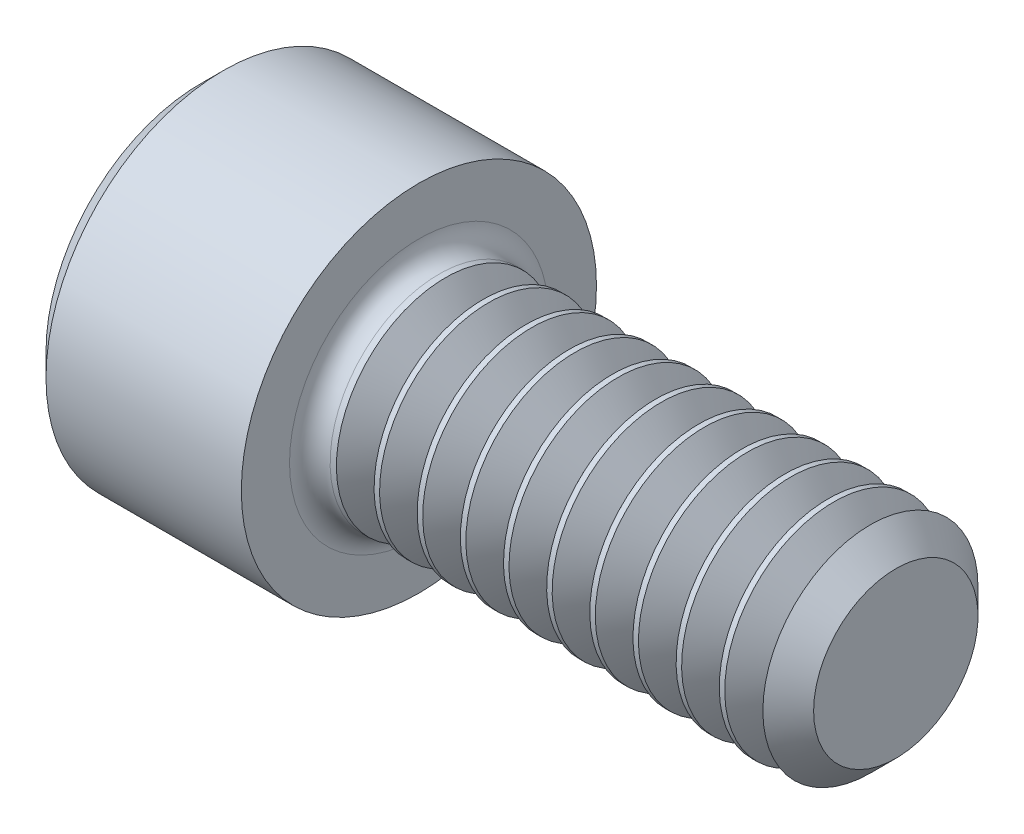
ISO-10303-21;
HEADER;
FILE_DESCRIPTION(('STEP AP214'),'2;1');
FILE_NAME('part.step','',(''),(''),'','','');
FILE_SCHEMA(('AUTOMOTIVE_DESIGN { 1 0 10303 214 1 1 1 1 }'));
ENDSEC;
DATA;
#1=APPLICATION_CONTEXT('core data for automotive mechanical design processes');
#2=APPLICATION_PROTOCOL_DEFINITION('international standard','automotive_design',2000,#1);
#3=PRODUCT_CONTEXT('',#1,'mechanical');
#4=PRODUCT('Part','Part','',(#3));
#5=PRODUCT_RELATED_PRODUCT_CATEGORY('part','',(#4));
#6=PRODUCT_DEFINITION_FORMATION('','',#4);
#7=PRODUCT_DEFINITION_CONTEXT('part definition',#1,'design');
#8=PRODUCT_DEFINITION('design','',#6,#7);
#9=PRODUCT_DEFINITION_SHAPE('','',#8);
#10=(LENGTH_UNIT() NAMED_UNIT(*) SI_UNIT(.MILLI.,.METRE.));
#11=(NAMED_UNIT(*) PLANE_ANGLE_UNIT() SI_UNIT($,.RADIAN.));
#12=(NAMED_UNIT(*) SI_UNIT($,.STERADIAN.) SOLID_ANGLE_UNIT());
#13=UNCERTAINTY_MEASURE_WITH_UNIT(LENGTH_MEASURE(1.E-05),#10,'distance_accuracy_value','');
#14=(GEOMETRIC_REPRESENTATION_CONTEXT(3) GLOBAL_UNCERTAINTY_ASSIGNED_CONTEXT((#13)) GLOBAL_UNIT_ASSIGNED_CONTEXT((#10,
#11,#12)) REPRESENTATION_CONTEXT('',''));
#15=CARTESIAN_POINT('',(0.,0.,0.));
#16=DIRECTION('',(0.,0.,1.));
#17=DIRECTION('',(1.,0.,0.));
#18=AXIS2_PLACEMENT_3D('',#15,#16,#17);
#19=CARTESIAN_POINT('',(0.,0.,0.));
#20=DIRECTION('',(-1.,0.,0.));
#21=DIRECTION('',(0.,0.,1.));
#22=AXIS2_PLACEMENT_3D('',#19,#20,#21);
#23=PLANE('',#22);
#24=DIRECTION('',(0.,-0.499999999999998,0.86602540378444));
#25=VECTOR('',#24,1.);
#26=CARTESIAN_POINT('',(0.,1.14384635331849,0.));
#27=LINE('',#26,#25);
#28=CARTESIAN_POINT('',(0.,1.14384635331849,0.));
#29=VERTEX_POINT('',#28);
#30=CARTESIAN_POINT('',(0.,0.57192317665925,0.990599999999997));
#31=VERTEX_POINT('',#30);
#32=EDGE_CURVE('E722',#29,#31,#27,.T.);
#33=ORIENTED_EDGE('',*,*,#32,.T.);
#34=DIRECTION('',(0.,1.,0.));
#35=VECTOR('',#34,1.);
#36=CARTESIAN_POINT('',(0.,-0.571923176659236,0.990599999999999));
#37=LINE('',#36,#35);
#38=CARTESIAN_POINT('',(0.,-0.571923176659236,0.990599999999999));
#39=VERTEX_POINT('',#38);
#40=EDGE_CURVE('E129',#39,#31,#37,.T.);
#41=ORIENTED_EDGE('',*,*,#40,.F.);
#42=DIRECTION('',(0.,-0.500000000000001,-0.866025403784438));
#43=VECTOR('',#42,1.);
#44=CARTESIAN_POINT('',(0.,-0.571923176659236,0.990599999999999));
#45=LINE('',#44,#43);
#46=CARTESIAN_POINT('',(0.,-1.14384635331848,0.));
#47=VERTEX_POINT('',#46);
#48=EDGE_CURVE('E741',#39,#47,#45,.T.);
#49=ORIENTED_EDGE('',*,*,#48,.T.);
#50=DIRECTION('',(0.,0.499999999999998,-0.86602540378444));
#51=VECTOR('',#50,1.);
#52=CARTESIAN_POINT('',(0.,-1.14384635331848,0.));
#53=LINE('',#52,#51);
#54=CARTESIAN_POINT('',(0.,-0.571923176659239,-0.990600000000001));
#55=VERTEX_POINT('',#54);
#56=EDGE_CURVE('E744',#47,#55,#53,.T.);
#57=ORIENTED_EDGE('',*,*,#56,.T.);
#58=DIRECTION('',(0.,-1.,0.));
#59=VECTOR('',#58,1.);
#60=CARTESIAN_POINT('',(0.,0.571923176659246,-0.990600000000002));
#61=LINE('',#60,#59);
#62=CARTESIAN_POINT('',(0.,0.571923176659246,-0.990600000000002));
#63=VERTEX_POINT('',#62);
#64=EDGE_CURVE('E747',#63,#55,#61,.T.);
#65=ORIENTED_EDGE('',*,*,#64,.F.);
#66=DIRECTION('',(0.,-0.500000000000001,-0.866025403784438));
#67=VECTOR('',#66,1.);
#68=CARTESIAN_POINT('',(0.,1.14384635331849,0.));
#69=LINE('',#68,#67);
#70=EDGE_CURVE('E124',#29,#63,#69,.T.);
#71=ORIENTED_EDGE('',*,*,#70,.F.);
#72=EDGE_LOOP('',(#33,#41,#49,#57,#65,#71));
#73=FACE_BOUND('',#72,.T.);
#74=CARTESIAN_POINT('',(0.,0.,0.));
#75=DIRECTION('',(-1.,0.,0.));
#76=DIRECTION('',(0.,0.,1.));
#77=AXIS2_PLACEMENT_3D('',#74,#75,#76);
#78=CIRCLE('',#77,1.5494);
#79=CARTESIAN_POINT('',(0.,0.,1.5494));
#80=VERTEX_POINT('',#79);
#81=EDGE_CURVE('E140',#80,#80,#78,.T.);
#82=ORIENTED_EDGE('',*,*,#81,.T.);
#83=EDGE_LOOP('',(#82));
#84=FACE_BOUND('',#83,.T.);
#85=ADVANCED_FACE('F32',(#73,#84),#23,.T.);
#86=CARTESIAN_POINT('',(-31.75,0.,0.));
#87=DIRECTION('',(-1.,0.,0.));
#88=DIRECTION('',(0.,0.,1.));
#89=AXIS2_PLACEMENT_3D('',#86,#87,#88);
#90=CYLINDRICAL_SURFACE('',#89,1.09219999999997);
#91=CARTESIAN_POINT('',(2.45053612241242,0.,0.));
#92=DIRECTION('',(-1.,0.,0.));
#93=DIRECTION('',(0.,-1.,0.));
#94=AXIS2_PLACEMENT_3D('',#91,#92,#93);
#95=CIRCLE('',#94,1.0922);
#96=CARTESIAN_POINT('',(2.45053612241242,-1.0922,0.));
#97=VERTEX_POINT('',#96);
#98=EDGE_CURVE('E717',#97,#97,#95,.T.);
#99=ORIENTED_EDGE('',*,*,#98,.T.);
#100=EDGE_LOOP('',(#99));
#101=FACE_BOUND('',#100,.T.);
#102=CARTESIAN_POINT('',(2.3876,0.,0.));
#103=DIRECTION('',(1.,0.,0.));
#104=DIRECTION('',(0.,0.,-1.));
#105=AXIS2_PLACEMENT_3D('',#102,#103,#104);
#106=CIRCLE('',#105,1.09219999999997);
#107=CARTESIAN_POINT('',(2.3876,0.,-1.09219999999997));
#108=VERTEX_POINT('',#107);
#109=EDGE_CURVE('E11',#108,#108,#106,.T.);
#110=ORIENTED_EDGE('',*,*,#109,.T.);
#111=EDGE_LOOP('',(#110));
#112=FACE_BOUND('',#111,.T.);
#113=ADVANCED_FACE('F172',(#101,#112),#90,.T.);
#114=CARTESIAN_POINT('',(2.1844,1.778,0.));
#115=DIRECTION('',(1.,0.,0.));
#116=DIRECTION('',(0.,0.,-1.));
#117=AXIS2_PLACEMENT_3D('',#114,#115,#116);
#118=PLANE('',#117);
#119=CARTESIAN_POINT('',(2.1844,0.,0.));
#120=DIRECTION('',(1.,0.,0.));
#121=DIRECTION('',(0.,0.,-1.));
#122=AXIS2_PLACEMENT_3D('',#119,#120,#121);
#123=CIRCLE('',#122,1.29539999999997);
#124=CARTESIAN_POINT('',(2.1844,0.,-1.29539999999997));
#125=VERTEX_POINT('',#124);
#126=EDGE_CURVE('E41',#125,#125,#123,.F.);
#127=ORIENTED_EDGE('',*,*,#126,.T.);
#128=EDGE_LOOP('',(#127));
#129=FACE_BOUND('',#128,.T.);
#130=CARTESIAN_POINT('',(2.1844,0.,0.));
#131=DIRECTION('',(-1.,0.,0.));
#132=DIRECTION('',(0.,0.,1.));
#133=AXIS2_PLACEMENT_3D('',#130,#131,#132);
#134=CIRCLE('',#133,1.778);
#135=CARTESIAN_POINT('',(2.1844,0.,1.778));
#136=VERTEX_POINT('',#135);
#137=EDGE_CURVE('E147',#136,#136,#134,.T.);
#138=ORIENTED_EDGE('',*,*,#137,.F.);
#139=EDGE_LOOP('',(#138));
#140=FACE_BOUND('',#139,.T.);
#141=ADVANCED_FACE('F156',(#129,#140),#118,.T.);
#142=CARTESIAN_POINT('',(-31.75,0.,0.));
#143=DIRECTION('',(-1.,0.,0.));
#144=DIRECTION('',(0.,0.,1.));
#145=AXIS2_PLACEMENT_3D('',#142,#143,#144);
#146=CYLINDRICAL_SURFACE('',#145,1.778);
#147=ORIENTED_EDGE('',*,*,#137,.T.);
#148=EDGE_LOOP('',(#147));
#149=FACE_BOUND('',#148,.T.);
#150=CARTESIAN_POINT('',(0.228600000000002,0.,0.));
#151=DIRECTION('',(-1.,0.,0.));
#152=DIRECTION('',(0.,0.,1.));
#153=AXIS2_PLACEMENT_3D('',#150,#151,#152);
#154=CIRCLE('',#153,1.778);
#155=CARTESIAN_POINT('',(0.228600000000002,0.,1.778));
#156=VERTEX_POINT('',#155);
#157=EDGE_CURVE('E144',#156,#156,#154,.T.);
#158=ORIENTED_EDGE('',*,*,#157,.F.);
#159=EDGE_LOOP('',(#158));
#160=FACE_BOUND('',#159,.T.);
#161=ADVANCED_FACE('F167',(#149,#160),#146,.T.);
#162=CARTESIAN_POINT('',(0.,0.,0.));
#163=DIRECTION('',(1.,0.,0.));
#164=DIRECTION('',(0.,0.,-1.));
#165=AXIS2_PLACEMENT_3D('',#162,#163,#164);
#166=CONICAL_SURFACE('',#165,1.5494,0.785398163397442);
#167=ORIENTED_EDGE('',*,*,#157,.T.);
#168=EDGE_LOOP('',(#167));
#169=FACE_BOUND('',#168,.T.);
#170=ORIENTED_EDGE('',*,*,#81,.F.);
#171=EDGE_LOOP('',(#170));
#172=FACE_BOUND('',#171,.T.);
#173=ADVANCED_FACE('F160',(#169,#172),#166,.T.);
#174=CARTESIAN_POINT('',(2.3876,0.,0.));
#175=DIRECTION('',(1.,0.,0.));
#176=DIRECTION('',(0.,0.,-1.));
#177=AXIS2_PLACEMENT_3D('',#174,#175,#176);
#178=TOROIDAL_SURFACE('',#177,1.29539999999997,0.2032);
#179=ORIENTED_EDGE('',*,*,#109,.F.);
#180=EDGE_LOOP('',(#179));
#181=FACE_BOUND('',#180,.T.);
#182=ORIENTED_EDGE('',*,*,#126,.F.);
#183=EDGE_LOOP('',(#182));
#184=FACE_BOUND('',#183,.T.);
#185=ADVANCED_FACE('F34',(#181,#184),#178,.F.);
#186=CARTESIAN_POINT('',(0.9652,1.14384635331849,0.));
#187=DIRECTION('',(0.,-0.86602540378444,-0.499999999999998));
#188=DIRECTION('',(0.,0.499999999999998,-0.86602540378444));
#189=AXIS2_PLACEMENT_3D('',#186,#187,#188);
#190=PLANE('',#189);
#191=ORIENTED_EDGE('',*,*,#32,.F.);
#192=DIRECTION('',(-1.,0.,0.));
#193=VECTOR('',#192,1.);
#194=CARTESIAN_POINT('',(0.9652,1.14384635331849,0.));
#195=LINE('',#194,#193);
#196=CARTESIAN_POINT('',(0.9652,1.14384635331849,0.));
#197=VERTEX_POINT('',#196);
#198=EDGE_CURVE('E738',#197,#29,#195,.T.);
#199=ORIENTED_EDGE('',*,*,#198,.F.);
#200=DIRECTION('',(0.,-0.499999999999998,0.86602540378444));
#201=VECTOR('',#200,1.);
#202=CARTESIAN_POINT('',(0.9652,1.14384635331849,0.));
#203=LINE('',#202,#201);
#204=CARTESIAN_POINT('',(0.9652,0.857884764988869,0.4953));
#205=VERTEX_POINT('',#204);
#206=EDGE_CURVE('E116',#197,#205,#203,.T.);
#207=ORIENTED_EDGE('',*,*,#206,.T.);
#208=CARTESIAN_POINT('',(0.9652,0.57192317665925,0.990599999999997));
#209=VERTEX_POINT('',#208);
#210=EDGE_CURVE('E107',#205,#209,#203,.T.);
#211=ORIENTED_EDGE('',*,*,#210,.T.);
#212=DIRECTION('',(-1.,0.,0.));
#213=VECTOR('',#212,1.);
#214=CARTESIAN_POINT('',(0.9652,0.57192317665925,0.990599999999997));
#215=LINE('',#214,#213);
#216=EDGE_CURVE('E121',#209,#31,#215,.T.);
#217=ORIENTED_EDGE('',*,*,#216,.T.);
#218=EDGE_LOOP('',(#191,#199,#207,#211,#217));
#219=FACE_BOUND('',#218,.T.);
#220=ADVANCED_FACE('F120',(#219),#190,.T.);
#221=CARTESIAN_POINT('',(0.9652,-0.571923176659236,0.990599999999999));
#222=DIRECTION('',(0.,0.,1.));
#223=DIRECTION('',(0.,-1.,0.));
#224=AXIS2_PLACEMENT_3D('',#221,#222,#223);
#225=PLANE('',#224);
#226=ORIENTED_EDGE('',*,*,#40,.T.);
#227=ORIENTED_EDGE('',*,*,#216,.F.);
#228=DIRECTION('',(0.,1.,0.));
#229=VECTOR('',#228,1.);
#230=CARTESIAN_POINT('',(0.9652,-0.571923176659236,0.990599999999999));
#231=LINE('',#230,#229);
#232=CARTESIAN_POINT('',(0.9652,0.,0.990599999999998));
#233=VERTEX_POINT('',#232);
#234=EDGE_CURVE('E104',#233,#209,#231,.T.);
#235=ORIENTED_EDGE('',*,*,#234,.F.);
#236=CARTESIAN_POINT('',(0.9652,-0.571923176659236,0.990599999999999));
#237=VERTEX_POINT('',#236);
#238=EDGE_CURVE('E115',#237,#233,#231,.T.);
#239=ORIENTED_EDGE('',*,*,#238,.F.);
#240=DIRECTION('',(-1.,0.,0.));
#241=VECTOR('',#240,1.);
#242=CARTESIAN_POINT('',(0.9652,-0.571923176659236,0.990599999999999));
#243=LINE('',#242,#241);
#244=EDGE_CURVE('E131',#237,#39,#243,.T.);
#245=ORIENTED_EDGE('',*,*,#244,.T.);
#246=EDGE_LOOP('',(#226,#227,#235,#239,#245));
#247=FACE_BOUND('',#246,.T.);
#248=ADVANCED_FACE('F126',(#247),#225,.F.);
#249=CARTESIAN_POINT('',(0.9652,-0.571923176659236,0.990599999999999));
#250=DIRECTION('',(0.,0.866025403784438,-0.500000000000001));
#251=DIRECTION('',(0.,0.500000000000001,0.866025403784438));
#252=AXIS2_PLACEMENT_3D('',#249,#250,#251);
#253=PLANE('',#252);
#254=ORIENTED_EDGE('',*,*,#48,.F.);
#255=ORIENTED_EDGE('',*,*,#244,.F.);
#256=DIRECTION('',(0.,-0.500000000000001,-0.866025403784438));
#257=VECTOR('',#256,1.);
#258=CARTESIAN_POINT('',(0.9652,-0.571923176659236,0.990599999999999));
#259=LINE('',#258,#257);
#260=CARTESIAN_POINT('',(0.9652,-0.857884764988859,0.495299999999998));
#261=VERTEX_POINT('',#260);
#262=EDGE_CURVE('E725',#237,#261,#259,.T.);
#263=ORIENTED_EDGE('',*,*,#262,.T.);
#264=CARTESIAN_POINT('',(0.9652,-1.14384635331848,0.));
#265=VERTEX_POINT('',#264);
#266=EDGE_CURVE('E724',#261,#265,#259,.T.);
#267=ORIENTED_EDGE('',*,*,#266,.T.);
#268=DIRECTION('',(-1.,0.,0.));
#269=VECTOR('',#268,1.);
#270=CARTESIAN_POINT('',(0.9652,-1.14384635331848,0.));
#271=LINE('',#270,#269);
#272=EDGE_CURVE('E136',#265,#47,#271,.T.);
#273=ORIENTED_EDGE('',*,*,#272,.T.);
#274=EDGE_LOOP('',(#254,#255,#263,#267,#273));
#275=FACE_BOUND('',#274,.T.);
#276=ADVANCED_FACE('F310',(#275),#253,.T.);
#277=CARTESIAN_POINT('',(0.9652,-1.14384635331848,0.));
#278=DIRECTION('',(0.,0.86602540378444,0.499999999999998));
#279=DIRECTION('',(0.,-0.499999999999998,0.86602540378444));
#280=AXIS2_PLACEMENT_3D('',#277,#278,#279);
#281=PLANE('',#280);
#282=ORIENTED_EDGE('',*,*,#56,.F.);
#283=ORIENTED_EDGE('',*,*,#272,.F.);
#284=DIRECTION('',(0.,0.499999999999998,-0.86602540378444));
#285=VECTOR('',#284,1.);
#286=CARTESIAN_POINT('',(0.9652,-1.14384635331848,0.));
#287=LINE('',#286,#285);
#288=CARTESIAN_POINT('',(0.9652,-0.857884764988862,-0.495299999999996));
#289=VERTEX_POINT('',#288);
#290=EDGE_CURVE('E729',#265,#289,#287,.T.);
#291=ORIENTED_EDGE('',*,*,#290,.T.);
#292=CARTESIAN_POINT('',(0.9652,-0.571923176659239,-0.990600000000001));
#293=VERTEX_POINT('',#292);
#294=EDGE_CURVE('E728',#289,#293,#287,.T.);
#295=ORIENTED_EDGE('',*,*,#294,.T.);
#296=DIRECTION('',(-1.,0.,0.));
#297=VECTOR('',#296,1.);
#298=CARTESIAN_POINT('',(0.9652,-0.571923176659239,-0.990600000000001));
#299=LINE('',#298,#297);
#300=EDGE_CURVE('E756',#293,#55,#299,.T.);
#301=ORIENTED_EDGE('',*,*,#300,.T.);
#302=EDGE_LOOP('',(#282,#283,#291,#295,#301));
#303=FACE_BOUND('',#302,.T.);
#304=ADVANCED_FACE('F306',(#303),#281,.T.);
#305=CARTESIAN_POINT('',(0.9652,0.571923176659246,-0.990600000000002));
#306=DIRECTION('',(0.,0.,-1.));
#307=DIRECTION('',(0.,1.,0.));
#308=AXIS2_PLACEMENT_3D('',#305,#306,#307);
#309=PLANE('',#308);
#310=ORIENTED_EDGE('',*,*,#64,.T.);
#311=ORIENTED_EDGE('',*,*,#300,.F.);
#312=DIRECTION('',(0.,-1.,0.));
#313=VECTOR('',#312,1.);
#314=CARTESIAN_POINT('',(0.9652,0.571923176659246,-0.990600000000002));
#315=LINE('',#314,#313);
#316=CARTESIAN_POINT('',(0.965200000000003,0.,-0.9906));
#317=VERTEX_POINT('',#316);
#318=EDGE_CURVE('E732',#317,#293,#315,.T.);
#319=ORIENTED_EDGE('',*,*,#318,.F.);
#320=CARTESIAN_POINT('',(0.9652,0.571923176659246,-0.990600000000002));
#321=VERTEX_POINT('',#320);
#322=EDGE_CURVE('E48',#321,#317,#315,.T.);
#323=ORIENTED_EDGE('',*,*,#322,.F.);
#324=DIRECTION('',(-1.,0.,0.));
#325=VECTOR('',#324,1.);
#326=CARTESIAN_POINT('',(0.9652,0.571923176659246,-0.990600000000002));
#327=LINE('',#326,#325);
#328=EDGE_CURVE('E753',#321,#63,#327,.T.);
#329=ORIENTED_EDGE('',*,*,#328,.T.);
#330=EDGE_LOOP('',(#310,#311,#319,#323,#329));
#331=FACE_BOUND('',#330,.T.);
#332=ADVANCED_FACE('F302',(#331),#309,.F.);
#333=CARTESIAN_POINT('',(0.9652,1.14384635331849,0.));
#334=DIRECTION('',(0.,0.866025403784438,-0.500000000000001));
#335=DIRECTION('',(0.,0.500000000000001,0.866025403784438));
#336=AXIS2_PLACEMENT_3D('',#333,#334,#335);
#337=PLANE('',#336);
#338=ORIENTED_EDGE('',*,*,#70,.T.);
#339=ORIENTED_EDGE('',*,*,#328,.F.);
#340=DIRECTION('',(0.,-0.500000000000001,-0.866025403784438));
#341=VECTOR('',#340,1.);
#342=CARTESIAN_POINT('',(0.9652,1.14384635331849,0.));
#343=LINE('',#342,#341);
#344=CARTESIAN_POINT('',(0.9652,0.857884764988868,-0.495300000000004));
#345=VERTEX_POINT('',#344);
#346=EDGE_CURVE('E734',#345,#321,#343,.T.);
#347=ORIENTED_EDGE('',*,*,#346,.F.);
#348=EDGE_CURVE('E735',#197,#345,#343,.T.);
#349=ORIENTED_EDGE('',*,*,#348,.F.);
#350=ORIENTED_EDGE('',*,*,#198,.T.);
#351=EDGE_LOOP('',(#338,#339,#347,#349,#350));
#352=FACE_BOUND('',#351,.T.);
#353=ADVANCED_FACE('F297',(#352),#337,.F.);
#354=CARTESIAN_POINT('',(0.9652,1.71576952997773,-0.990600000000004));
#355=DIRECTION('',(1.,0.,0.));
#356=DIRECTION('',(0.,0.,-1.));
#357=AXIS2_PLACEMENT_3D('',#354,#355,#356);
#358=PLANE('',#357);
#359=ORIENTED_EDGE('',*,*,#318,.T.);
#360=ORIENTED_EDGE('',*,*,#294,.F.);
#361=CARTESIAN_POINT('',(0.965200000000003,0.,0.));
#362=DIRECTION('',(-1.,0.,0.));
#363=DIRECTION('',(0.,0.,1.));
#364=AXIS2_PLACEMENT_3D('',#361,#362,#363);
#365=CIRCLE('',#364,0.9906);
#366=EDGE_CURVE('E771',#317,#289,#365,.T.);
#367=ORIENTED_EDGE('',*,*,#366,.F.);
#368=EDGE_LOOP('',(#359,#360,#367));
#369=FACE_BOUND('',#368,.T.);
#370=ADVANCED_FACE('F293',(#369),#358,.F.);
#371=ORIENTED_EDGE('',*,*,#290,.F.);
#372=ORIENTED_EDGE('',*,*,#266,.F.);
#373=EDGE_CURVE('E134',#289,#261,#365,.T.);
#374=ORIENTED_EDGE('',*,*,#373,.F.);
#375=EDGE_LOOP('',(#371,#372,#374));
#376=FACE_BOUND('',#375,.T.);
#377=ADVANCED_FACE('F296',(#376),#358,.F.);
#378=ORIENTED_EDGE('',*,*,#262,.F.);
#379=ORIENTED_EDGE('',*,*,#238,.T.);
#380=EDGE_CURVE('E130',#261,#233,#365,.T.);
#381=ORIENTED_EDGE('',*,*,#380,.F.);
#382=EDGE_LOOP('',(#378,#379,#381));
#383=FACE_BOUND('',#382,.T.);
#384=ADVANCED_FACE('F346',(#383),#358,.F.);
#385=ORIENTED_EDGE('',*,*,#234,.T.);
#386=ORIENTED_EDGE('',*,*,#210,.F.);
#387=EDGE_CURVE('E110',#233,#205,#365,.T.);
#388=ORIENTED_EDGE('',*,*,#387,.F.);
#389=EDGE_LOOP('',(#385,#386,#388));
#390=FACE_BOUND('',#389,.T.);
#391=ADVANCED_FACE('F106',(#390),#358,.F.);
#392=ORIENTED_EDGE('',*,*,#206,.F.);
#393=ORIENTED_EDGE('',*,*,#348,.T.);
#394=EDGE_CURVE('E141',#205,#345,#365,.T.);
#395=ORIENTED_EDGE('',*,*,#394,.F.);
#396=EDGE_LOOP('',(#392,#393,#395));
#397=FACE_BOUND('',#396,.T.);
#398=ADVANCED_FACE('F359',(#397),#358,.F.);
#399=ORIENTED_EDGE('',*,*,#346,.T.);
#400=ORIENTED_EDGE('',*,*,#322,.T.);
#401=EDGE_CURVE('E770',#345,#317,#365,.T.);
#402=ORIENTED_EDGE('',*,*,#401,.F.);
#403=EDGE_LOOP('',(#399,#400,#402));
#404=FACE_BOUND('',#403,.T.);
#405=ADVANCED_FACE('F299',(#404),#358,.F.);
#406=CARTESIAN_POINT('',(0.965200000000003,0.,0.));
#407=DIRECTION('',(-1.,0.,0.));
#408=DIRECTION('',(0.,0.,1.));
#409=AXIS2_PLACEMENT_3D('',#406,#407,#408);
#410=CONICAL_SURFACE('',#409,0.9906,1.04719755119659);
#411=CARTESIAN_POINT('',(1.53712317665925,0.,0.));
#412=VERTEX_POINT('',#411);
#413=VERTEX_LOOP('',#412);
#414=FACE_BOUND('',#413,.T.);
#415=ORIENTED_EDGE('',*,*,#387,.T.);
#416=ORIENTED_EDGE('',*,*,#394,.T.);
#417=ORIENTED_EDGE('',*,*,#401,.T.);
#418=ORIENTED_EDGE('',*,*,#366,.T.);
#419=ORIENTED_EDGE('',*,*,#373,.T.);
#420=ORIENTED_EDGE('',*,*,#380,.T.);
#421=EDGE_LOOP('',(#415,#416,#417,#418,#419,#420));
#422=FACE_BOUND('',#421,.T.);
#423=ADVANCED_FACE('F184',(#414,#422),#410,.F.);
#424=CARTESIAN_POINT('',(2.82758387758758,0.,0.));
#425=DIRECTION('',(1.,0.,0.));
#426=DIRECTION('',(0.,1.,0.));
#427=AXIS2_PLACEMENT_3D('',#424,#425,#426);
#428=CONICAL_SURFACE('',#427,1.0922,0.959931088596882);
#429=CARTESIAN_POINT('',(2.63906,0.,0.));
#430=DIRECTION('',(-1.,0.,0.));
#431=DIRECTION('',(0.,-1.,0.));
#432=AXIS2_PLACEMENT_3D('',#429,#430,#431);
#433=CIRCLE('',#432,0.822960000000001);
#434=CARTESIAN_POINT('',(2.63906,-0.82296,0.));
#435=VERTEX_POINT('',#434);
#436=EDGE_CURVE('E714',#435,#435,#433,.T.);
#437=ORIENTED_EDGE('',*,*,#436,.F.);
#438=EDGE_LOOP('',(#437));
#439=FACE_BOUND('',#438,.T.);
#440=CARTESIAN_POINT('',(2.82758387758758,0.,0.));
#441=DIRECTION('',(-1.,0.,0.));
#442=DIRECTION('',(0.,-1.,0.));
#443=AXIS2_PLACEMENT_3D('',#440,#441,#442);
#444=CIRCLE('',#443,1.0922);
#445=CARTESIAN_POINT('',(2.82758387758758,-1.0922,0.));
#446=VERTEX_POINT('',#445);
#447=EDGE_CURVE('E720',#446,#446,#444,.T.);
#448=ORIENTED_EDGE('',*,*,#447,.T.);
#449=EDGE_LOOP('',(#448));
#450=FACE_BOUND('',#449,.T.);
#451=ADVANCED_FACE('F288',(#439,#450),#428,.T.);
#452=CARTESIAN_POINT('',(2.63906,0.,0.));
#453=DIRECTION('',(-1.,0.,0.));
#454=DIRECTION('',(0.,-1.,0.));
#455=AXIS2_PLACEMENT_3D('',#452,#453,#454);
#456=CONICAL_SURFACE('',#455,0.822960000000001,0.959931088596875);
#457=ORIENTED_EDGE('',*,*,#98,.F.);
#458=EDGE_LOOP('',(#457));
#459=FACE_BOUND('',#458,.T.);
#460=ORIENTED_EDGE('',*,*,#436,.T.);
#461=EDGE_LOOP('',(#460));
#462=FACE_BOUND('',#461,.T.);
#463=ADVANCED_FACE('F285',(#459,#462),#456,.T.);
#464=CARTESIAN_POINT('',(2.88259012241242,0.,0.));
#465=DIRECTION('',(-1.,0.,0.));
#466=DIRECTION('',(0.,-1.,0.));
#467=AXIS2_PLACEMENT_3D('',#464,#465,#466);
#468=CIRCLE('',#467,1.0922);
#469=CARTESIAN_POINT('',(2.88259012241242,-1.0922,0.));
#470=VERTEX_POINT('',#469);
#471=EDGE_CURVE('E708',#470,#470,#468,.T.);
#472=ORIENTED_EDGE('',*,*,#471,.T.);
#473=EDGE_LOOP('',(#472));
#474=FACE_BOUND('',#473,.T.);
#475=ORIENTED_EDGE('',*,*,#447,.F.);
#476=EDGE_LOOP('',(#475));
#477=FACE_BOUND('',#476,.T.);
#478=ADVANCED_FACE('F181',(#474,#477),#90,.T.);
#479=CARTESIAN_POINT('',(3.25963787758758,0.,0.));
#480=DIRECTION('',(1.,0.,0.));
#481=DIRECTION('',(0.,1.,0.));
#482=AXIS2_PLACEMENT_3D('',#479,#480,#481);
#483=CONICAL_SURFACE('',#482,1.0922,0.959931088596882);
#484=CARTESIAN_POINT('',(3.071114,0.,0.));
#485=DIRECTION('',(-1.,0.,0.));
#486=DIRECTION('',(0.,-1.,0.));
#487=AXIS2_PLACEMENT_3D('',#484,#485,#486);
#488=CIRCLE('',#487,0.822960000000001);
#489=CARTESIAN_POINT('',(3.071114,-0.82296,0.));
#490=VERTEX_POINT('',#489);
#491=EDGE_CURVE('E705',#490,#490,#488,.T.);
#492=ORIENTED_EDGE('',*,*,#491,.F.);
#493=EDGE_LOOP('',(#492));
#494=FACE_BOUND('',#493,.T.);
#495=CARTESIAN_POINT('',(3.25963787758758,0.,0.));
#496=DIRECTION('',(-1.,0.,0.));
#497=DIRECTION('',(0.,-1.,0.));
#498=AXIS2_PLACEMENT_3D('',#495,#496,#497);
#499=CIRCLE('',#498,1.0922);
#500=CARTESIAN_POINT('',(3.25963787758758,-1.0922,0.));
#501=VERTEX_POINT('',#500);
#502=EDGE_CURVE('E711',#501,#501,#499,.T.);
#503=ORIENTED_EDGE('',*,*,#502,.T.);
#504=EDGE_LOOP('',(#503));
#505=FACE_BOUND('',#504,.T.);
#506=ADVANCED_FACE('F280',(#494,#505),#483,.T.);
#507=CARTESIAN_POINT('',(3.071114,0.,0.));
#508=DIRECTION('',(-1.,0.,0.));
#509=DIRECTION('',(0.,-1.,0.));
#510=AXIS2_PLACEMENT_3D('',#507,#508,#509);
#511=CONICAL_SURFACE('',#510,0.822960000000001,0.959931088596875);
#512=ORIENTED_EDGE('',*,*,#471,.F.);
#513=EDGE_LOOP('',(#512));
#514=FACE_BOUND('',#513,.T.);
#515=ORIENTED_EDGE('',*,*,#491,.T.);
#516=EDGE_LOOP('',(#515));
#517=FACE_BOUND('',#516,.T.);
#518=ADVANCED_FACE('F277',(#514,#517),#511,.T.);
#519=CARTESIAN_POINT('',(3.31464412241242,0.,0.));
#520=DIRECTION('',(-1.,0.,0.));
#521=DIRECTION('',(0.,-1.,0.));
#522=AXIS2_PLACEMENT_3D('',#519,#520,#521);
#523=CIRCLE('',#522,1.0922);
#524=CARTESIAN_POINT('',(3.31464412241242,-1.0922,0.));
#525=VERTEX_POINT('',#524);
#526=EDGE_CURVE('E699',#525,#525,#523,.T.);
#527=ORIENTED_EDGE('',*,*,#526,.T.);
#528=EDGE_LOOP('',(#527));
#529=FACE_BOUND('',#528,.T.);
#530=ORIENTED_EDGE('',*,*,#502,.F.);
#531=EDGE_LOOP('',(#530));
#532=FACE_BOUND('',#531,.T.);
#533=ADVANCED_FACE('F275',(#529,#532),#90,.T.);
#534=CARTESIAN_POINT('',(3.69169187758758,0.,0.));
#535=DIRECTION('',(1.,0.,0.));
#536=DIRECTION('',(0.,1.,0.));
#537=AXIS2_PLACEMENT_3D('',#534,#535,#536);
#538=CONICAL_SURFACE('',#537,1.0922,0.959931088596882);
#539=CARTESIAN_POINT('',(3.503168,0.,0.));
#540=DIRECTION('',(-1.,0.,0.));
#541=DIRECTION('',(0.,-1.,0.));
#542=AXIS2_PLACEMENT_3D('',#539,#540,#541);
#543=CIRCLE('',#542,0.822960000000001);
#544=CARTESIAN_POINT('',(3.503168,-0.82296,0.));
#545=VERTEX_POINT('',#544);
#546=EDGE_CURVE('E696',#545,#545,#543,.T.);
#547=ORIENTED_EDGE('',*,*,#546,.F.);
#548=EDGE_LOOP('',(#547));
#549=FACE_BOUND('',#548,.T.);
#550=CARTESIAN_POINT('',(3.69169187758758,0.,0.));
#551=DIRECTION('',(-1.,0.,0.));
#552=DIRECTION('',(0.,-1.,0.));
#553=AXIS2_PLACEMENT_3D('',#550,#551,#552);
#554=CIRCLE('',#553,1.0922);
#555=CARTESIAN_POINT('',(3.69169187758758,-1.0922,0.));
#556=VERTEX_POINT('',#555);
#557=EDGE_CURVE('E702',#556,#556,#554,.T.);
#558=ORIENTED_EDGE('',*,*,#557,.T.);
#559=EDGE_LOOP('',(#558));
#560=FACE_BOUND('',#559,.T.);
#561=ADVANCED_FACE('F271',(#549,#560),#538,.T.);
#562=CARTESIAN_POINT('',(3.503168,0.,0.));
#563=DIRECTION('',(-1.,0.,0.));
#564=DIRECTION('',(0.,-1.,0.));
#565=AXIS2_PLACEMENT_3D('',#562,#563,#564);
#566=CONICAL_SURFACE('',#565,0.822960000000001,0.959931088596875);
#567=ORIENTED_EDGE('',*,*,#526,.F.);
#568=EDGE_LOOP('',(#567));
#569=FACE_BOUND('',#568,.T.);
#570=ORIENTED_EDGE('',*,*,#546,.T.);
#571=EDGE_LOOP('',(#570));
#572=FACE_BOUND('',#571,.T.);
#573=ADVANCED_FACE('F268',(#569,#572),#566,.T.);
#574=CARTESIAN_POINT('',(3.74669812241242,0.,0.));
#575=DIRECTION('',(-1.,0.,0.));
#576=DIRECTION('',(0.,-1.,0.));
#577=AXIS2_PLACEMENT_3D('',#574,#575,#576);
#578=CIRCLE('',#577,1.0922);
#579=CARTESIAN_POINT('',(3.74669812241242,-1.0922,0.));
#580=VERTEX_POINT('',#579);
#581=EDGE_CURVE('E690',#580,#580,#578,.T.);
#582=ORIENTED_EDGE('',*,*,#581,.T.);
#583=EDGE_LOOP('',(#582));
#584=FACE_BOUND('',#583,.T.);
#585=ORIENTED_EDGE('',*,*,#557,.F.);
#586=EDGE_LOOP('',(#585));
#587=FACE_BOUND('',#586,.T.);
#588=ADVANCED_FACE('F266',(#584,#587),#90,.T.);
#589=CARTESIAN_POINT('',(4.12374587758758,0.,0.));
#590=DIRECTION('',(1.,0.,0.));
#591=DIRECTION('',(0.,1.,0.));
#592=AXIS2_PLACEMENT_3D('',#589,#590,#591);
#593=CONICAL_SURFACE('',#592,1.0922,0.959931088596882);
#594=CARTESIAN_POINT('',(3.935222,0.,0.));
#595=DIRECTION('',(-1.,0.,0.));
#596=DIRECTION('',(0.,-1.,0.));
#597=AXIS2_PLACEMENT_3D('',#594,#595,#596);
#598=CIRCLE('',#597,0.822960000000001);
#599=CARTESIAN_POINT('',(3.935222,-0.82296,0.));
#600=VERTEX_POINT('',#599);
#601=EDGE_CURVE('E687',#600,#600,#598,.T.);
#602=ORIENTED_EDGE('',*,*,#601,.F.);
#603=EDGE_LOOP('',(#602));
#604=FACE_BOUND('',#603,.T.);
#605=CARTESIAN_POINT('',(4.12374587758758,0.,0.));
#606=DIRECTION('',(-1.,0.,0.));
#607=DIRECTION('',(0.,-1.,0.));
#608=AXIS2_PLACEMENT_3D('',#605,#606,#607);
#609=CIRCLE('',#608,1.0922);
#610=CARTESIAN_POINT('',(4.12374587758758,-1.0922,0.));
#611=VERTEX_POINT('',#610);
#612=EDGE_CURVE('E693',#611,#611,#609,.T.);
#613=ORIENTED_EDGE('',*,*,#612,.T.);
#614=EDGE_LOOP('',(#613));
#615=FACE_BOUND('',#614,.T.);
#616=ADVANCED_FACE('F262',(#604,#615),#593,.T.);
#617=CARTESIAN_POINT('',(3.935222,0.,0.));
#618=DIRECTION('',(-1.,0.,0.));
#619=DIRECTION('',(0.,-1.,0.));
#620=AXIS2_PLACEMENT_3D('',#617,#618,#619);
#621=CONICAL_SURFACE('',#620,0.822960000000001,0.959931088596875);
#622=ORIENTED_EDGE('',*,*,#581,.F.);
#623=EDGE_LOOP('',(#622));
#624=FACE_BOUND('',#623,.T.);
#625=ORIENTED_EDGE('',*,*,#601,.T.);
#626=EDGE_LOOP('',(#625));
#627=FACE_BOUND('',#626,.T.);
#628=ADVANCED_FACE('F259',(#624,#627),#621,.T.);
#629=CARTESIAN_POINT('',(4.17875212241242,0.,0.));
#630=DIRECTION('',(-1.,0.,0.));
#631=DIRECTION('',(0.,-1.,0.));
#632=AXIS2_PLACEMENT_3D('',#629,#630,#631);
#633=CIRCLE('',#632,1.0922);
#634=CARTESIAN_POINT('',(4.17875212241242,-1.0922,0.));
#635=VERTEX_POINT('',#634);
#636=EDGE_CURVE('E681',#635,#635,#633,.T.);
#637=ORIENTED_EDGE('',*,*,#636,.T.);
#638=EDGE_LOOP('',(#637));
#639=FACE_BOUND('',#638,.T.);
#640=ORIENTED_EDGE('',*,*,#612,.F.);
#641=EDGE_LOOP('',(#640));
#642=FACE_BOUND('',#641,.T.);
#643=ADVANCED_FACE('F257',(#639,#642),#90,.T.);
#644=CARTESIAN_POINT('',(4.55579987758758,0.,0.));
#645=DIRECTION('',(1.,0.,0.));
#646=DIRECTION('',(0.,1.,0.));
#647=AXIS2_PLACEMENT_3D('',#644,#645,#646);
#648=CONICAL_SURFACE('',#647,1.0922,0.959931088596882);
#649=CARTESIAN_POINT('',(4.367276,0.,0.));
#650=DIRECTION('',(-1.,0.,0.));
#651=DIRECTION('',(0.,-1.,0.));
#652=AXIS2_PLACEMENT_3D('',#649,#650,#651);
#653=CIRCLE('',#652,0.822960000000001);
#654=CARTESIAN_POINT('',(4.367276,-0.82296,0.));
#655=VERTEX_POINT('',#654);
#656=EDGE_CURVE('E678',#655,#655,#653,.T.);
#657=ORIENTED_EDGE('',*,*,#656,.F.);
#658=EDGE_LOOP('',(#657));
#659=FACE_BOUND('',#658,.T.);
#660=CARTESIAN_POINT('',(4.55579987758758,0.,0.));
#661=DIRECTION('',(-1.,0.,0.));
#662=DIRECTION('',(0.,-1.,0.));
#663=AXIS2_PLACEMENT_3D('',#660,#661,#662);
#664=CIRCLE('',#663,1.0922);
#665=CARTESIAN_POINT('',(4.55579987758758,-1.0922,0.));
#666=VERTEX_POINT('',#665);
#667=EDGE_CURVE('E684',#666,#666,#664,.T.);
#668=ORIENTED_EDGE('',*,*,#667,.T.);
#669=EDGE_LOOP('',(#668));
#670=FACE_BOUND('',#669,.T.);
#671=ADVANCED_FACE('F253',(#659,#670),#648,.T.);
#672=CARTESIAN_POINT('',(4.367276,0.,0.));
#673=DIRECTION('',(-1.,0.,0.));
#674=DIRECTION('',(0.,-1.,0.));
#675=AXIS2_PLACEMENT_3D('',#672,#673,#674);
#676=CONICAL_SURFACE('',#675,0.822960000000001,0.959931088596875);
#677=ORIENTED_EDGE('',*,*,#636,.F.);
#678=EDGE_LOOP('',(#677));
#679=FACE_BOUND('',#678,.T.);
#680=ORIENTED_EDGE('',*,*,#656,.T.);
#681=EDGE_LOOP('',(#680));
#682=FACE_BOUND('',#681,.T.);
#683=ADVANCED_FACE('F250',(#679,#682),#676,.T.);
#684=CARTESIAN_POINT('',(4.61080612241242,0.,0.));
#685=DIRECTION('',(-1.,0.,0.));
#686=DIRECTION('',(0.,-1.,0.));
#687=AXIS2_PLACEMENT_3D('',#684,#685,#686);
#688=CIRCLE('',#687,1.0922);
#689=CARTESIAN_POINT('',(4.61080612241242,-1.0922,0.));
#690=VERTEX_POINT('',#689);
#691=EDGE_CURVE('E672',#690,#690,#688,.T.);
#692=ORIENTED_EDGE('',*,*,#691,.T.);
#693=EDGE_LOOP('',(#692));
#694=FACE_BOUND('',#693,.T.);
#695=ORIENTED_EDGE('',*,*,#667,.F.);
#696=EDGE_LOOP('',(#695));
#697=FACE_BOUND('',#696,.T.);
#698=ADVANCED_FACE('F248',(#694,#697),#90,.T.);
#699=CARTESIAN_POINT('',(4.98785387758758,0.,0.));
#700=DIRECTION('',(1.,0.,0.));
#701=DIRECTION('',(0.,1.,0.));
#702=AXIS2_PLACEMENT_3D('',#699,#700,#701);
#703=CONICAL_SURFACE('',#702,1.0922,0.959931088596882);
#704=CARTESIAN_POINT('',(4.79933,0.,0.));
#705=DIRECTION('',(-1.,0.,0.));
#706=DIRECTION('',(0.,-1.,0.));
#707=AXIS2_PLACEMENT_3D('',#704,#705,#706);
#708=CIRCLE('',#707,0.822960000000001);
#709=CARTESIAN_POINT('',(4.79933,-0.82296,0.));
#710=VERTEX_POINT('',#709);
#711=EDGE_CURVE('E669',#710,#710,#708,.T.);
#712=ORIENTED_EDGE('',*,*,#711,.F.);
#713=EDGE_LOOP('',(#712));
#714=FACE_BOUND('',#713,.T.);
#715=CARTESIAN_POINT('',(4.98785387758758,0.,0.));
#716=DIRECTION('',(-1.,0.,0.));
#717=DIRECTION('',(0.,-1.,0.));
#718=AXIS2_PLACEMENT_3D('',#715,#716,#717);
#719=CIRCLE('',#718,1.0922);
#720=CARTESIAN_POINT('',(4.98785387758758,-1.0922,0.));
#721=VERTEX_POINT('',#720);
#722=EDGE_CURVE('E675',#721,#721,#719,.T.);
#723=ORIENTED_EDGE('',*,*,#722,.T.);
#724=EDGE_LOOP('',(#723));
#725=FACE_BOUND('',#724,.T.);
#726=ADVANCED_FACE('F244',(#714,#725),#703,.T.);
#727=CARTESIAN_POINT('',(4.79933,0.,0.));
#728=DIRECTION('',(-1.,0.,0.));
#729=DIRECTION('',(0.,-1.,0.));
#730=AXIS2_PLACEMENT_3D('',#727,#728,#729);
#731=CONICAL_SURFACE('',#730,0.822960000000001,0.959931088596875);
#732=ORIENTED_EDGE('',*,*,#691,.F.);
#733=EDGE_LOOP('',(#732));
#734=FACE_BOUND('',#733,.T.);
#735=ORIENTED_EDGE('',*,*,#711,.T.);
#736=EDGE_LOOP('',(#735));
#737=FACE_BOUND('',#736,.T.);
#738=ADVANCED_FACE('F241',(#734,#737),#731,.T.);
#739=CARTESIAN_POINT('',(5.04286012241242,0.,0.));
#740=DIRECTION('',(-1.,0.,0.));
#741=DIRECTION('',(0.,-1.,0.));
#742=AXIS2_PLACEMENT_3D('',#739,#740,#741);
#743=CIRCLE('',#742,1.0922);
#744=CARTESIAN_POINT('',(5.04286012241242,-1.0922,0.));
#745=VERTEX_POINT('',#744);
#746=EDGE_CURVE('E663',#745,#745,#743,.T.);
#747=ORIENTED_EDGE('',*,*,#746,.T.);
#748=EDGE_LOOP('',(#747));
#749=FACE_BOUND('',#748,.T.);
#750=ORIENTED_EDGE('',*,*,#722,.F.);
#751=EDGE_LOOP('',(#750));
#752=FACE_BOUND('',#751,.T.);
#753=ADVANCED_FACE('F239',(#749,#752),#90,.T.);
#754=CARTESIAN_POINT('',(5.41990787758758,0.,0.));
#755=DIRECTION('',(1.,0.,0.));
#756=DIRECTION('',(0.,1.,0.));
#757=AXIS2_PLACEMENT_3D('',#754,#755,#756);
#758=CONICAL_SURFACE('',#757,1.0922,0.959931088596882);
#759=CARTESIAN_POINT('',(5.231384,0.,0.));
#760=DIRECTION('',(-1.,0.,0.));
#761=DIRECTION('',(0.,-1.,0.));
#762=AXIS2_PLACEMENT_3D('',#759,#760,#761);
#763=CIRCLE('',#762,0.822960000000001);
#764=CARTESIAN_POINT('',(5.231384,-0.82296,0.));
#765=VERTEX_POINT('',#764);
#766=EDGE_CURVE('E660',#765,#765,#763,.T.);
#767=ORIENTED_EDGE('',*,*,#766,.F.);
#768=EDGE_LOOP('',(#767));
#769=FACE_BOUND('',#768,.T.);
#770=CARTESIAN_POINT('',(5.41990787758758,0.,0.));
#771=DIRECTION('',(-1.,0.,0.));
#772=DIRECTION('',(0.,-1.,0.));
#773=AXIS2_PLACEMENT_3D('',#770,#771,#772);
#774=CIRCLE('',#773,1.0922);
#775=CARTESIAN_POINT('',(5.41990787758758,-1.0922,0.));
#776=VERTEX_POINT('',#775);
#777=EDGE_CURVE('E666',#776,#776,#774,.T.);
#778=ORIENTED_EDGE('',*,*,#777,.T.);
#779=EDGE_LOOP('',(#778));
#780=FACE_BOUND('',#779,.T.);
#781=ADVANCED_FACE('F235',(#769,#780),#758,.T.);
#782=CARTESIAN_POINT('',(5.231384,0.,0.));
#783=DIRECTION('',(-1.,0.,0.));
#784=DIRECTION('',(0.,-1.,0.));
#785=AXIS2_PLACEMENT_3D('',#782,#783,#784);
#786=CONICAL_SURFACE('',#785,0.822960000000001,0.959931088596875);
#787=ORIENTED_EDGE('',*,*,#746,.F.);
#788=EDGE_LOOP('',(#787));
#789=FACE_BOUND('',#788,.T.);
#790=ORIENTED_EDGE('',*,*,#766,.T.);
#791=EDGE_LOOP('',(#790));
#792=FACE_BOUND('',#791,.T.);
#793=ADVANCED_FACE('F232',(#789,#792),#786,.T.);
#794=CARTESIAN_POINT('',(5.47491412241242,0.,0.));
#795=DIRECTION('',(-1.,0.,0.));
#796=DIRECTION('',(0.,-1.,0.));
#797=AXIS2_PLACEMENT_3D('',#794,#795,#796);
#798=CIRCLE('',#797,1.0922);
#799=CARTESIAN_POINT('',(5.47491412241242,-1.0922,0.));
#800=VERTEX_POINT('',#799);
#801=EDGE_CURVE('E648',#800,#800,#798,.T.);
#802=ORIENTED_EDGE('',*,*,#801,.T.);
#803=EDGE_LOOP('',(#802));
#804=FACE_BOUND('',#803,.T.);
#805=ORIENTED_EDGE('',*,*,#777,.F.);
#806=EDGE_LOOP('',(#805));
#807=FACE_BOUND('',#806,.T.);
#808=ADVANCED_FACE('F230',(#804,#807),#90,.T.);
#809=CARTESIAN_POINT('',(5.85196187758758,0.,0.));
#810=DIRECTION('',(1.,0.,0.));
#811=DIRECTION('',(0.,1.,0.));
#812=AXIS2_PLACEMENT_3D('',#809,#810,#811);
#813=CONICAL_SURFACE('',#812,1.0922,0.959931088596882);
#814=CARTESIAN_POINT('',(5.663438,0.,0.));
#815=DIRECTION('',(-1.,0.,0.));
#816=DIRECTION('',(0.,-1.,0.));
#817=AXIS2_PLACEMENT_3D('',#814,#815,#816);
#818=CIRCLE('',#817,0.822960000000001);
#819=CARTESIAN_POINT('',(5.663438,-0.82296,0.));
#820=VERTEX_POINT('',#819);
#821=EDGE_CURVE('E644',#820,#820,#818,.T.);
#822=ORIENTED_EDGE('',*,*,#821,.F.);
#823=EDGE_LOOP('',(#822));
#824=FACE_BOUND('',#823,.T.);
#825=CARTESIAN_POINT('',(5.85196187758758,0.,0.));
#826=DIRECTION('',(-1.,0.,0.));
#827=DIRECTION('',(0.,-1.,0.));
#828=AXIS2_PLACEMENT_3D('',#825,#826,#827);
#829=CIRCLE('',#828,1.0922);
#830=CARTESIAN_POINT('',(5.85196187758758,-1.0922,0.));
#831=VERTEX_POINT('',#830);
#832=EDGE_CURVE('E657',#831,#831,#829,.T.);
#833=ORIENTED_EDGE('',*,*,#832,.T.);
#834=EDGE_LOOP('',(#833));
#835=FACE_BOUND('',#834,.T.);
#836=ADVANCED_FACE('F226',(#824,#835),#813,.T.);
#837=CARTESIAN_POINT('',(5.663438,0.,0.));
#838=DIRECTION('',(-1.,0.,0.));
#839=DIRECTION('',(0.,-1.,0.));
#840=AXIS2_PLACEMENT_3D('',#837,#838,#839);
#841=CONICAL_SURFACE('',#840,0.822960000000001,0.959931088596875);
#842=ORIENTED_EDGE('',*,*,#801,.F.);
#843=EDGE_LOOP('',(#842));
#844=FACE_BOUND('',#843,.T.);
#845=ORIENTED_EDGE('',*,*,#821,.T.);
#846=EDGE_LOOP('',(#845));
#847=FACE_BOUND('',#846,.T.);
#848=ADVANCED_FACE('F223',(#844,#847),#841,.T.);
#849=CARTESIAN_POINT('',(5.90696812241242,0.,0.));
#850=DIRECTION('',(-1.,0.,0.));
#851=DIRECTION('',(0.,-1.,0.));
#852=AXIS2_PLACEMENT_3D('',#849,#850,#851);
#853=CIRCLE('',#852,1.0922);
#854=CARTESIAN_POINT('',(5.90696812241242,-1.0922,0.));
#855=VERTEX_POINT('',#854);
#856=EDGE_CURVE('E645',#855,#855,#853,.T.);
#857=ORIENTED_EDGE('',*,*,#856,.T.);
#858=EDGE_LOOP('',(#857));
#859=FACE_BOUND('',#858,.T.);
#860=ORIENTED_EDGE('',*,*,#832,.F.);
#861=EDGE_LOOP('',(#860));
#862=FACE_BOUND('',#861,.T.);
#863=ADVANCED_FACE('F221',(#859,#862),#90,.T.);
#864=CARTESIAN_POINT('',(6.28401587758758,0.,0.));
#865=DIRECTION('',(1.,0.,0.));
#866=DIRECTION('',(0.,1.,0.));
#867=AXIS2_PLACEMENT_3D('',#864,#865,#866);
#868=CONICAL_SURFACE('',#867,1.0922,0.959931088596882);
#869=CARTESIAN_POINT('',(6.095492,0.,0.));
#870=DIRECTION('',(-1.,0.,0.));
#871=DIRECTION('',(0.,-1.,0.));
#872=AXIS2_PLACEMENT_3D('',#869,#870,#871);
#873=CIRCLE('',#872,0.822960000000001);
#874=CARTESIAN_POINT('',(6.095492,-0.82296,0.));
#875=VERTEX_POINT('',#874);
#876=EDGE_CURVE('E651',#875,#875,#873,.T.);
#877=ORIENTED_EDGE('',*,*,#876,.F.);
#878=EDGE_LOOP('',(#877));
#879=FACE_BOUND('',#878,.T.);
#880=CARTESIAN_POINT('',(6.28401587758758,0.,0.));
#881=DIRECTION('',(-1.,0.,0.));
#882=DIRECTION('',(0.,-1.,0.));
#883=AXIS2_PLACEMENT_3D('',#880,#881,#882);
#884=CIRCLE('',#883,1.0922);
#885=CARTESIAN_POINT('',(6.28401587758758,-1.0922,0.));
#886=VERTEX_POINT('',#885);
#887=EDGE_CURVE('E642',#886,#886,#884,.T.);
#888=ORIENTED_EDGE('',*,*,#887,.T.);
#889=EDGE_LOOP('',(#888));
#890=FACE_BOUND('',#889,.T.);
#891=ADVANCED_FACE('F217',(#879,#890),#868,.T.);
#892=CARTESIAN_POINT('',(6.095492,0.,0.));
#893=DIRECTION('',(-1.,0.,0.));
#894=DIRECTION('',(0.,-1.,0.));
#895=AXIS2_PLACEMENT_3D('',#892,#893,#894);
#896=CONICAL_SURFACE('',#895,0.822960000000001,0.959931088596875);
#897=ORIENTED_EDGE('',*,*,#856,.F.);
#898=EDGE_LOOP('',(#897));
#899=FACE_BOUND('',#898,.T.);
#900=ORIENTED_EDGE('',*,*,#876,.T.);
#901=EDGE_LOOP('',(#900));
#902=FACE_BOUND('',#901,.T.);
#903=ADVANCED_FACE('F214',(#899,#902),#896,.T.);
#904=CARTESIAN_POINT('',(6.33902212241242,0.,0.));
#905=DIRECTION('',(-1.,0.,0.));
#906=DIRECTION('',(0.,-1.,0.));
#907=AXIS2_PLACEMENT_3D('',#904,#905,#906);
#908=CIRCLE('',#907,1.0922);
#909=CARTESIAN_POINT('',(6.33902212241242,-1.0922,0.));
#910=VERTEX_POINT('',#909);
#911=EDGE_CURVE('E639',#910,#910,#908,.T.);
#912=ORIENTED_EDGE('',*,*,#911,.T.);
#913=EDGE_LOOP('',(#912));
#914=FACE_BOUND('',#913,.T.);
#915=ORIENTED_EDGE('',*,*,#887,.F.);
#916=EDGE_LOOP('',(#915));
#917=FACE_BOUND('',#916,.T.);
#918=ADVANCED_FACE('F180',(#914,#917),#90,.T.);
#919=CARTESIAN_POINT('',(6.71606987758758,0.,0.));
#920=DIRECTION('',(1.,0.,0.));
#921=DIRECTION('',(0.,1.,0.));
#922=AXIS2_PLACEMENT_3D('',#919,#920,#921);
#923=CONICAL_SURFACE('',#922,1.0922,0.959931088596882);
#924=CARTESIAN_POINT('',(6.527546,0.,0.));
#925=DIRECTION('',(-1.,0.,0.));
#926=DIRECTION('',(0.,-1.,0.));
#927=AXIS2_PLACEMENT_3D('',#924,#925,#926);
#928=CIRCLE('',#927,0.822960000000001);
#929=CARTESIAN_POINT('',(6.527546,-0.82296,0.));
#930=VERTEX_POINT('',#929);
#931=EDGE_CURVE('E830',#930,#930,#928,.T.);
#932=ORIENTED_EDGE('',*,*,#931,.F.);
#933=EDGE_LOOP('',(#932));
#934=FACE_BOUND('',#933,.T.);
#935=CARTESIAN_POINT('',(6.70548161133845,0.,0.));
#936=DIRECTION('',(1.,0.,0.));
#937=DIRECTION('',(0.,1.,0.));
#938=AXIS2_PLACEMENT_3D('',#935,#936,#937);
#939=CIRCLE('',#938,1.07707838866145);
#940=CARTESIAN_POINT('',(6.70548161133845,1.07707838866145,0.));
#941=VERTEX_POINT('',#940);
#942=EDGE_CURVE('E36',#941,#941,#939,.T.);
#943=ORIENTED_EDGE('',*,*,#942,.F.);
#944=EDGE_LOOP('',(#943));
#945=FACE_BOUND('',#944,.T.);
#946=ADVANCED_FACE('F201',(#934,#945),#923,.T.);
#947=CARTESIAN_POINT('',(6.527546,0.,0.));
#948=DIRECTION('',(-1.,0.,0.));
#949=DIRECTION('',(0.,-1.,0.));
#950=AXIS2_PLACEMENT_3D('',#947,#948,#949);
#951=CONICAL_SURFACE('',#950,0.822960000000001,0.959931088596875);
#952=ORIENTED_EDGE('',*,*,#911,.F.);
#953=EDGE_LOOP('',(#952));
#954=FACE_BOUND('',#953,.T.);
#955=ORIENTED_EDGE('',*,*,#931,.T.);
#956=EDGE_LOOP('',(#955));
#957=FACE_BOUND('',#956,.T.);
#958=ADVANCED_FACE('F196',(#954,#957),#951,.T.);
#959=CARTESIAN_POINT('',(6.9596,0.82296,0.));
#960=DIRECTION('',(1.,0.,0.));
#961=DIRECTION('',(0.,0.,-1.));
#962=AXIS2_PLACEMENT_3D('',#959,#960,#961);
#963=PLANE('',#962);
#964=CARTESIAN_POINT('',(6.9596,0.,0.));
#965=DIRECTION('',(-1.,0.,0.));
#966=DIRECTION('',(0.,0.,1.));
#967=AXIS2_PLACEMENT_3D('',#964,#965,#966);
#968=CIRCLE('',#967,0.82296);
#969=CARTESIAN_POINT('',(6.9596,0.,0.82296));
#970=VERTEX_POINT('',#969);
#971=EDGE_CURVE('E150',#970,#970,#968,.T.);
#972=ORIENTED_EDGE('',*,*,#971,.F.);
#973=EDGE_LOOP('',(#972));
#974=FACE_BOUND('',#973,.T.);
#975=ADVANCED_FACE('F193',(#974),#963,.T.);
#976=CARTESIAN_POINT('',(6.9596,0.,0.));
#977=DIRECTION('',(-1.,0.,0.));
#978=DIRECTION('',(0.,0.,1.));
#979=AXIS2_PLACEMENT_3D('',#976,#977,#978);
#980=CONICAL_SURFACE('',#979,0.82296,0.785398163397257);
#981=ORIENTED_EDGE('',*,*,#942,.T.);
#982=EDGE_LOOP('',(#981));
#983=FACE_BOUND('',#982,.T.);
#984=ORIENTED_EDGE('',*,*,#971,.T.);
#985=EDGE_LOOP('',(#984));
#986=FACE_BOUND('',#985,.T.);
#987=ADVANCED_FACE('F191',(#983,#986),#980,.T.);
#988=CLOSED_SHELL('',(#85,#113,#141,#161,#173,#185,#220,#248,#276,#304,#332,#353,#370,#377,#384,
#391,#398,#405,#423,#451,#463,#478,#506,#518,#533,#561,#573,#588,#616,#628,#643,#671,#683,#698,
#726,#738,#753,#781,#793,#808,#836,#848,#863,#891,#903,#918,#946,#958,#975,#987));
#989=MANIFOLD_SOLID_BREP('B2',#988);
#990=ADVANCED_BREP_SHAPE_REPRESENTATION('',(#18,#989),#14);
#991=SHAPE_DEFINITION_REPRESENTATION(#9,#990);
ENDSEC;
END-ISO-10303-21;
